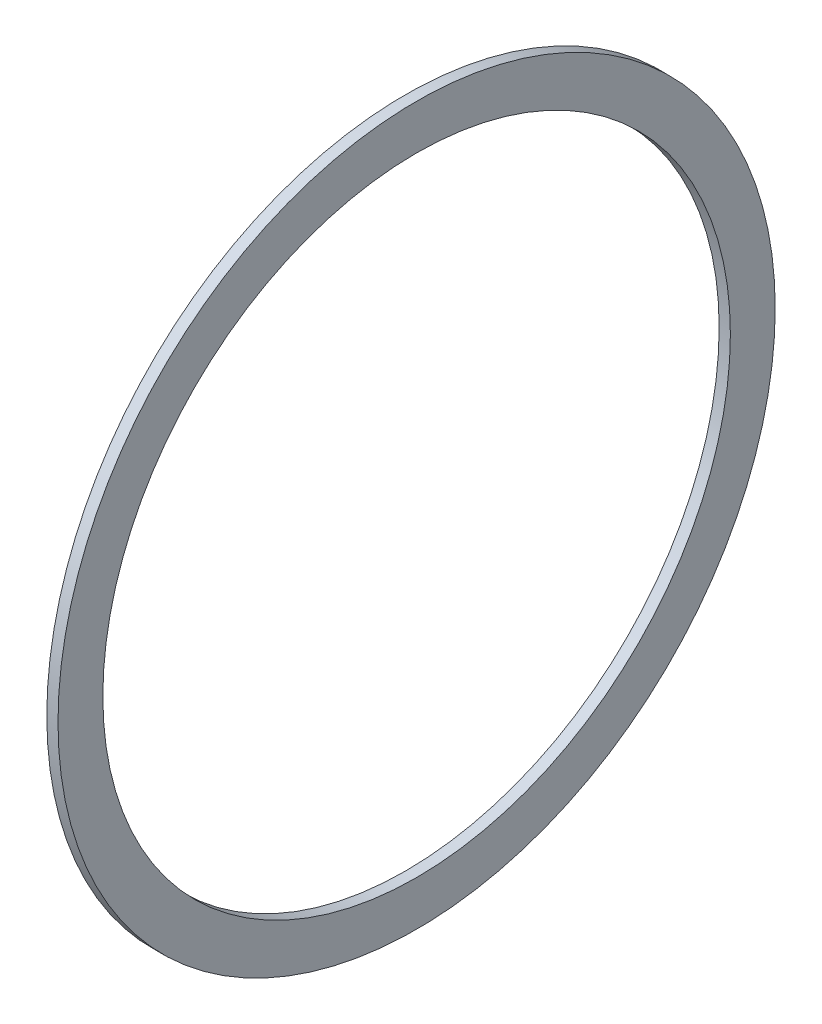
from build123d import *

# Parameters (mm, degrees)
SKETCH1_W = 3.175
SKETCH1_H = 12.7


with BuildPart() as part:
    # Sketch1 → Revolve1 (revolve)
    with BuildSketch(Plane(origin=(0, 0, 0), x_dir=(1, 0, 0), z_dir=(0, 1, 0)), mode=Mode.PRIVATE) as revolve1_sk:
        with Locations((1.5875, 95.25)):
            Rectangle(SKETCH1_W, SKETCH1_H)
    revolve(revolve1_sk.sketch.rotate(Axis((0, 0, 0), (1, 0, 0)), 180), axis=Axis((0, 0, 0), (1, 0, 0)))


solid = part.part
